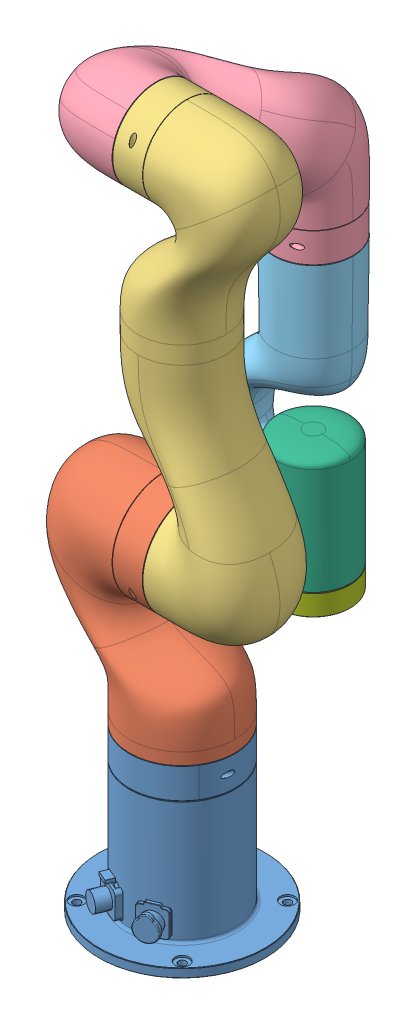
SolidWorks assembly FX85_M.SLDASM, configuration 默认 (file format 9000). Lengths in mm.
Overall size (237.32 804.15 302.81).
7 component instances, 7 part files, 14 mates.
Components (placement in the parent):
- FX85_P01-1: FX85_P01.sldprt [默认] x (-0.143915 0 -0.98959) z (0.98959 0 -0.143915) size (190 185.25 190)
- FX85_P02-1: FX85_P02.sldprt [默认] at (17.8064 478.4801 64.6043) x (0 0 -1) z (1 0 0) size (120.79 238.56 185.22)
- FX85_P03-1: FX85_P03.sldprt [默认] at (53.0564 478.4801 64.6043) x (0 0 -1) z (-1 0 0) size (120.01 500.37 162.4)
- FX85_P04-1: FX85_P04.sldprt [默认] at (7.8064 743.4869 -85.372) x (0 0 -1) z (1 0 0) size (245.13 209.65 165.06)
- FX85_P05-1: FX85_P05.sldprt [默认] at (37.8064 615.7369 -85.372) size (160.06 304.01 90.31)
- FX85_P06-1: FX85_P06.sldprt [默认] at (-12.9436 442.7369 -85.372) x (1 0 0) z (0 -1 0) size (92.57 84.53 131.9)
- FX85_P07-1: FX85_P07.sldprt [默认] at (37.5564 352.7369 -85.372) x (1 0 0) z (0 1 0) size (88.42 84 30)
Mates (geometry in assembly coordinates):
- 同心1: concentric anti-aligned: cylinder of FX85_P01-1 through (37.8064 264.4801 64.6043) axis (0 1 0) radius 95; cylinder of FX85_P02-1 through (37.8064 313.4801 64.6043) axis (0 -1 0) radius 60
- 距离1: distance = 0.25 mm anti-aligned: plane of FX85_P01-1 through (6.2068 299.7301 115.6088) normal (0 1 0); plane of FX85_P02-1 through (37.8064 299.9801 64.6043) normal (0 -1 0)
- 平行2: parallel aligned: plane of FX85_P01-1; plane of assembly through (0 0 0) normal (0 0 1)
- 同心2: concentric anti-aligned: circle of FX85_P02-1; circle of FX85_P03-1
- 距离2: distance = 0.25 mm anti-aligned: plane of FX85_P03-1 through (53.0564 478.4801 64.6043) normal (-1 0 0); plane of FX85_P02-1 through (52.8064 478.4801 64.6043) normal (1 0 0)
- 同心3: concentric aligned: circle of FX85_P03-1; circle of FX85_P04-1
- 距离3: distance = 0.25 mm anti-aligned: plane of FX85_P04-1 through (7.8064 743.4869 -85.372) normal (1 0 0); plane of FX85_P03-1 through (8.0564 868.4801 64.6043) normal (-1 0 0)
- 同心4: concentric aligned: circle of FX85_P04-1; circle of FX85_P05-1
- 距离4: distance = 0.25 mm anti-aligned: plane of FX85_P04-1 through (37.8064 708.9869 -85.372) normal (0 -1 0); plane of FX85_P05-1 through (82.8064 708.7369 -85.372) normal (0 1 0)
- 同心5: concentric aligned: circle of FX85_P05-1; circle of FX85_P06-1
- 距离5: distance = 0.25 mm anti-aligned: plane of FX85_P05-1 through (-13.1936 442.7369 -85.372) normal (1 0 0); plane of FX85_P06-1 through (-12.9436 423.7369 -66.372) normal (-1 0 0)
- 同心6: concentric aligned: circle of FX85_P06-1; circle of FX85_P07-1
- 距离6: distance = 0.6 mm anti-aligned: plane of FX85_P07-1 through (37.5564 382.7369 -85.372) normal (0 1 0); plane of FX85_P06-1 through (37.5564 383.3369 -85.372) normal (0 -1 0)
- 平行3: parallel anti-aligned: plane of FX85_P01-1 through (37.8064 114.4801 64.6043) normal (0 -1 0); plane of assembly through (0 0 0) normal (0 1 0)
